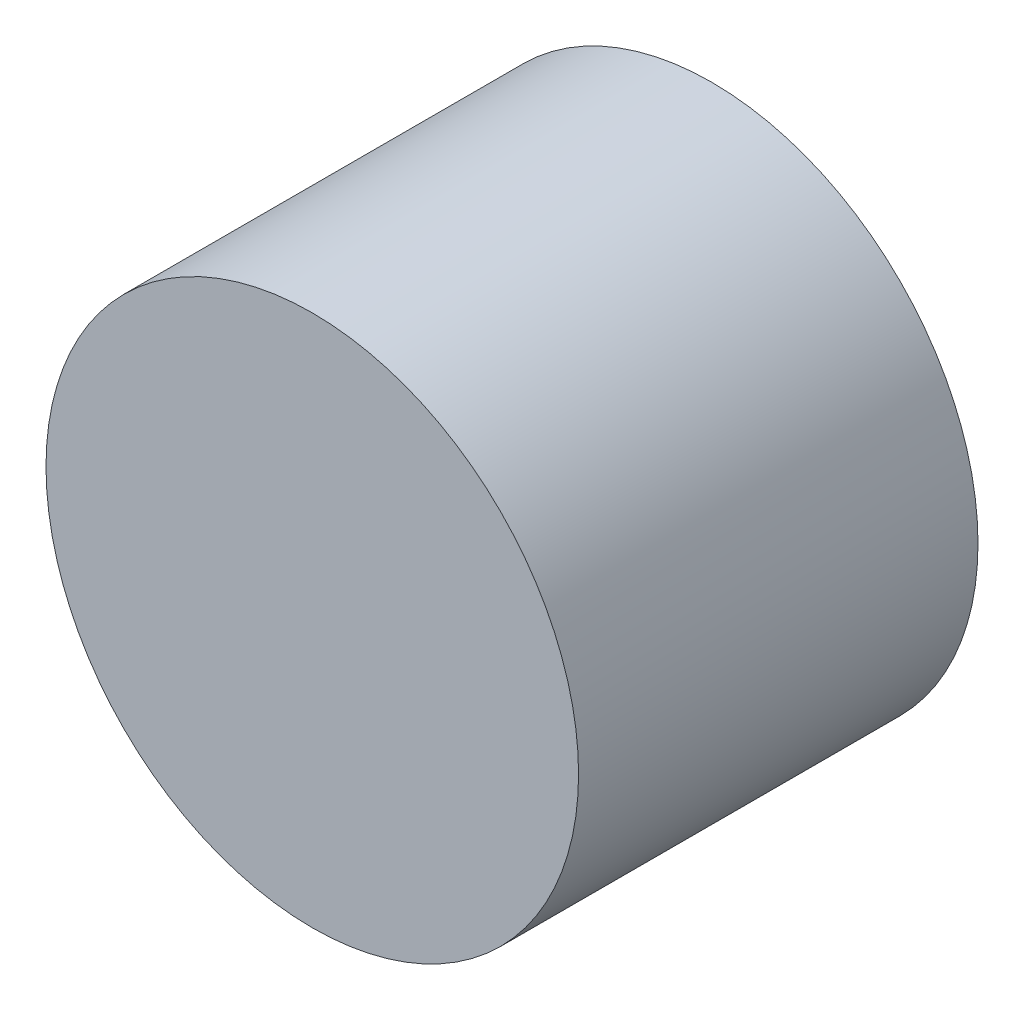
from build123d import *

# Parameters (mm, degrees)
EXTRUDE1_DEPTH = 75


with BuildPart() as part:
    # Sketch1 → Extrude1 (new, symmetric)
    with BuildSketch(Plane.XY):
        with BuildLine():
            ThreePointArc((100, 0), (0, 100), (-100, 0))
            ThreePointArc((-100, 0), (0, -100), (100, 0))
        make_face()
    extrude(amount=EXTRUDE1_DEPTH, both=True)


solid = part.part
